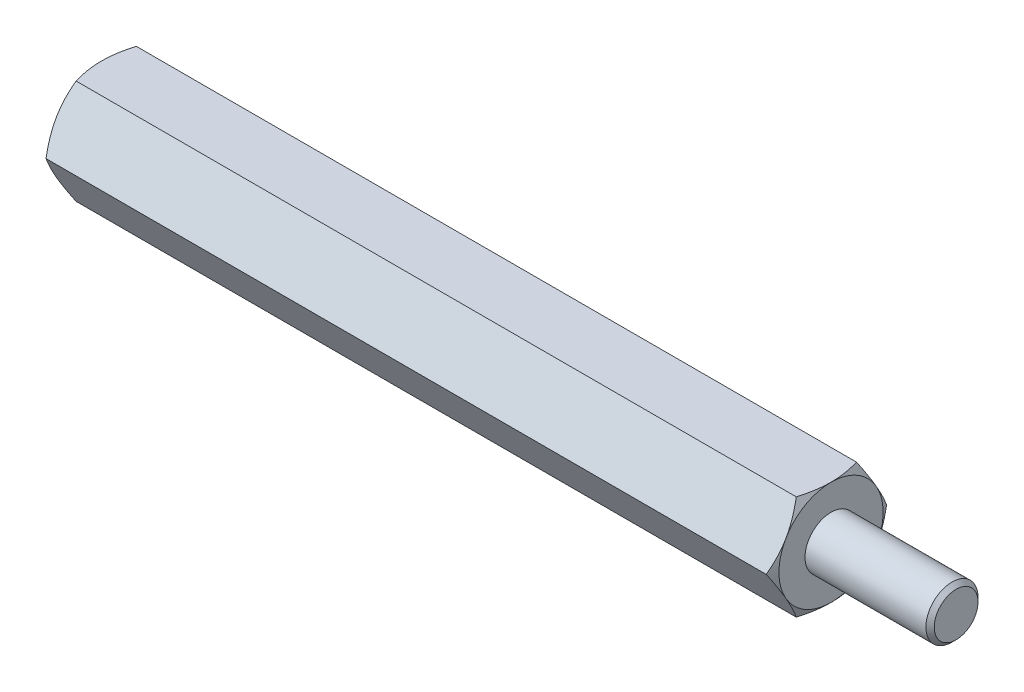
ISO-10303-21;
HEADER;
FILE_DESCRIPTION(('STEP AP214'),'2;1');
FILE_NAME('part.step','',(''),(''),'','','');
FILE_SCHEMA(('AUTOMOTIVE_DESIGN { 1 0 10303 214 1 1 1 1 }'));
ENDSEC;
DATA;
#1=APPLICATION_CONTEXT('core data for automotive mechanical design processes');
#2=APPLICATION_PROTOCOL_DEFINITION('international standard','automotive_design',2000,#1);
#3=PRODUCT_CONTEXT('',#1,'mechanical');
#4=PRODUCT('Part','Part','',(#3));
#5=PRODUCT_RELATED_PRODUCT_CATEGORY('part','',(#4));
#6=PRODUCT_DEFINITION_FORMATION('','',#4);
#7=PRODUCT_DEFINITION_CONTEXT('part definition',#1,'design');
#8=PRODUCT_DEFINITION('design','',#6,#7);
#9=PRODUCT_DEFINITION_SHAPE('','',#8);
#10=(LENGTH_UNIT() NAMED_UNIT(*) SI_UNIT(.MILLI.,.METRE.));
#11=(NAMED_UNIT(*) PLANE_ANGLE_UNIT() SI_UNIT($,.RADIAN.));
#12=(NAMED_UNIT(*) SI_UNIT($,.STERADIAN.) SOLID_ANGLE_UNIT());
#13=UNCERTAINTY_MEASURE_WITH_UNIT(LENGTH_MEASURE(1.E-05),#10,'distance_accuracy_value','');
#14=(GEOMETRIC_REPRESENTATION_CONTEXT(3) GLOBAL_UNCERTAINTY_ASSIGNED_CONTEXT((#13)) GLOBAL_UNIT_ASSIGNED_CONTEXT((#10,
#11,#12)) REPRESENTATION_CONTEXT('',''));
#15=CARTESIAN_POINT('',(0.,0.,0.));
#16=DIRECTION('',(0.,0.,1.));
#17=DIRECTION('',(1.,0.,0.));
#18=AXIS2_PLACEMENT_3D('',#15,#16,#17);
#19=CARTESIAN_POINT('',(17.5,2.5,-1.44337567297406));
#20=DIRECTION('',(1.,0.,0.));
#21=DIRECTION('',(0.,0.,-1.));
#22=AXIS2_PLACEMENT_3D('',#19,#20,#21);
#23=PLANE('',#22);
#24=CARTESIAN_POINT('',(17.5,0.,0.));
#25=DIRECTION('',(1.,0.,0.));
#26=DIRECTION('',(0.,0.,-1.));
#27=AXIS2_PLACEMENT_3D('',#24,#25,#26);
#28=CIRCLE('',#27,2.5);
#29=CARTESIAN_POINT('',(17.5,-1.25,-2.1650635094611));
#30=VERTEX_POINT('',#29);
#31=CARTESIAN_POINT('',(17.5,1.25,-2.1650635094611));
#32=VERTEX_POINT('',#31);
#33=EDGE_CURVE('E288',#30,#32,#28,.T.);
#34=ORIENTED_EDGE('',*,*,#33,.T.);
#35=CARTESIAN_POINT('',(17.5,2.5,0.));
#36=VERTEX_POINT('',#35);
#37=EDGE_CURVE('E53',#32,#36,#28,.T.);
#38=ORIENTED_EDGE('',*,*,#37,.T.);
#39=CARTESIAN_POINT('',(17.5,1.25,2.1650635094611));
#40=VERTEX_POINT('',#39);
#41=EDGE_CURVE('E296',#36,#40,#28,.T.);
#42=ORIENTED_EDGE('',*,*,#41,.T.);
#43=CARTESIAN_POINT('',(17.5,-1.25000000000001,2.1650635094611));
#44=VERTEX_POINT('',#43);
#45=EDGE_CURVE('E300',#40,#44,#28,.T.);
#46=ORIENTED_EDGE('',*,*,#45,.T.);
#47=CARTESIAN_POINT('',(17.5,0.,0.));
#48=DIRECTION('',(-1.,0.,0.));
#49=DIRECTION('',(0.,-1.,0.));
#50=AXIS2_PLACEMENT_3D('',#47,#48,#49);
#51=CIRCLE('',#50,2.5);
#52=CARTESIAN_POINT('',(17.5,-2.50000000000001,0.));
#53=VERTEX_POINT('',#52);
#54=EDGE_CURVE('E193',#53,#44,#51,.T.);
#55=ORIENTED_EDGE('',*,*,#54,.F.);
#56=EDGE_CURVE('E61',#53,#30,#28,.T.);
#57=ORIENTED_EDGE('',*,*,#56,.T.);
#58=EDGE_LOOP('',(#34,#38,#42,#46,#55,#57));
#59=FACE_BOUND('',#58,.T.);
#60=CARTESIAN_POINT('',(17.5,0.,0.));
#61=DIRECTION('',(1.,0.,0.));
#62=DIRECTION('',(0.,0.,-1.));
#63=AXIS2_PLACEMENT_3D('',#60,#61,#62);
#64=CIRCLE('',#63,1.25);
#65=CARTESIAN_POINT('',(17.5,0.,-1.25));
#66=VERTEX_POINT('',#65);
#67=EDGE_CURVE('E310',#66,#66,#64,.T.);
#68=ORIENTED_EDGE('',*,*,#67,.F.);
#69=EDGE_LOOP('',(#68));
#70=FACE_BOUND('',#69,.T.);
#71=ADVANCED_FACE('F37',(#59,#70),#23,.T.);
#72=CARTESIAN_POINT('',(17.5,0.,-2.88675134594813));
#73=DIRECTION('',(0.,-0.5,0.866025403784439));
#74=DIRECTION('',(0.,-0.866025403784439,-0.5));
#75=AXIS2_PLACEMENT_3D('',#72,#73,#74);
#76=PLANE('',#75);
#77=CARTESIAN_POINT('',(17.2766423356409,-0.000199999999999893,-2.88686681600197));
#78=CARTESIAN_POINT('',(17.3132783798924,0.109663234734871,-2.82343724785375));
#79=CARTESIAN_POINT('',(17.346597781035,0.220474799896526,-2.75946016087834));
#80=CARTESIAN_POINT('',(17.4047577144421,0.44401683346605,-2.63039810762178));
#81=CARTESIAN_POINT('',(17.4295776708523,0.556751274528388,-2.5653108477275));
#82=CARTESIAN_POINT('',(17.468214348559,0.780822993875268,-2.43594298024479));
#83=CARTESIAN_POINT('',(17.4822882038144,0.892125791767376,-2.37168227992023));
#84=CARTESIAN_POINT('',(17.4990908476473,1.11525522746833,-2.24285844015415));
#85=CARTESIAN_POINT('',(17.5018335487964,1.22708105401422,-2.17829576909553));
#86=CARTESIAN_POINT('',(17.4961342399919,1.43604197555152,-2.05765212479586));
#87=CARTESIAN_POINT('',(17.4890916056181,1.53320831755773,-2.0015531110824));
#88=CARTESIAN_POINT('',(17.4667685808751,1.726907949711,-1.88972057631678));
#89=CARTESIAN_POINT('',(17.4514805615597,1.82344056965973,-1.8339874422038));
#90=CARTESIAN_POINT('',(17.4132609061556,2.01753972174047,-1.7219242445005));
#91=CARTESIAN_POINT('',(17.3901672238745,2.11508168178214,-1.66560836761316));
#92=CARTESIAN_POINT('',(17.3377533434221,2.30871060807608,-1.55381665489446));
#93=CARTESIAN_POINT('',(17.3084454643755,2.40480005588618,-1.49833938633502));
#94=CARTESIAN_POINT('',(17.2766423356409,2.5002,-1.44326020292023));
#95=B_SPLINE_CURVE_WITH_KNOTS('',3,(#77,#78,#79,#80,#81,#82,#83,#84,#85,#86,#87,#88,#89,#90,#91,
#92,#93,#94),.UNSPECIFIED.,.F.,.F.,(4,2,2,2,2,2,2,2,4),(0.,0.396285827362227,0.79352433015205,
1.18093086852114,1.56786160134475,1.90479741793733,2.24204551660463,2.58677531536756,
2.93082800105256),.UNSPECIFIED.);
#96=CARTESIAN_POINT('',(17.2767090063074,0.,-2.88675134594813));
#97=VERTEX_POINT('',#96);
#98=EDGE_CURVE('E348',#97,#32,#95,.T.);
#99=ORIENTED_EDGE('',*,*,#98,.F.);
#100=DIRECTION('',(-1.,0.,0.));
#101=VECTOR('',#100,1.);
#102=CARTESIAN_POINT('',(17.5,0.,-2.88675134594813));
#103=LINE('',#102,#101);
#104=CARTESIAN_POINT('',(-17.2767090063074,0.,-2.88675134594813));
#105=VERTEX_POINT('',#104);
#106=EDGE_CURVE('E264',#97,#105,#103,.T.);
#107=ORIENTED_EDGE('',*,*,#106,.T.);
#108=CARTESIAN_POINT('',(-17.2766423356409,2.5002,-1.44326020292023));
#109=CARTESIAN_POINT('',(-17.3132783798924,2.39033676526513,-1.50668977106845));
#110=CARTESIAN_POINT('',(-17.346597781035,2.27952520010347,-1.57066685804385));
#111=CARTESIAN_POINT('',(-17.4047577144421,2.05598316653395,-1.69972891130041));
#112=CARTESIAN_POINT('',(-17.4295776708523,1.94324872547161,-1.7648161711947));
#113=CARTESIAN_POINT('',(-17.468214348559,1.71917700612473,-1.8941840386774));
#114=CARTESIAN_POINT('',(-17.4822882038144,1.60787420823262,-1.95844473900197));
#115=CARTESIAN_POINT('',(-17.4990908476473,1.38474477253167,-2.08726857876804));
#116=CARTESIAN_POINT('',(-17.5018335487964,1.27291894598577,-2.15183124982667));
#117=CARTESIAN_POINT('',(-17.4961342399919,1.06395802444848,-2.27247489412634));
#118=CARTESIAN_POINT('',(-17.4890916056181,0.966791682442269,-2.32857390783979));
#119=CARTESIAN_POINT('',(-17.4667685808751,0.773092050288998,-2.44040644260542));
#120=CARTESIAN_POINT('',(-17.4514805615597,0.676559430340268,-2.49613957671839));
#121=CARTESIAN_POINT('',(-17.4132609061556,0.482460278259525,-2.60820277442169));
#122=CARTESIAN_POINT('',(-17.3901672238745,0.38491831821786,-2.66451865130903));
#123=CARTESIAN_POINT('',(-17.3377533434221,0.191289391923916,-2.77631036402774));
#124=CARTESIAN_POINT('',(-17.3084454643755,0.0951999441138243,-2.83178763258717));
#125=CARTESIAN_POINT('',(-17.2766423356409,-0.000200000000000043,-2.88686681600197));
#126=B_SPLINE_CURVE_WITH_KNOTS('',3,(#108,#109,#110,#111,#112,#113,#114,#115,#116,#117,#118,
#119,#120,#121,#122,#123,#124,#125),.UNSPECIFIED.,.F.,.F.,(4,2,2,2,2,2,2,2,4),(0.,
0.396285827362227,0.793524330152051,1.18093086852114,1.56786160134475,1.90479741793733,
2.24204551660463,2.58677531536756,2.93082800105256),.UNSPECIFIED.);
#127=CARTESIAN_POINT('',(-17.5,1.25,-2.1650635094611));
#128=VERTEX_POINT('',#127);
#129=EDGE_CURVE('E338',#128,#105,#126,.T.);
#130=ORIENTED_EDGE('',*,*,#129,.F.);
#131=CARTESIAN_POINT('',(-17.2767090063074,2.5,-1.44337567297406));
#132=VERTEX_POINT('',#131);
#133=EDGE_CURVE('E392',#132,#128,#126,.T.);
#134=ORIENTED_EDGE('',*,*,#133,.F.);
#135=DIRECTION('',(-1.,0.,0.));
#136=VECTOR('',#135,1.);
#137=CARTESIAN_POINT('',(17.5,2.5,-1.44337567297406));
#138=LINE('',#137,#136);
#139=CARTESIAN_POINT('',(17.2767090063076,2.5,-1.44337567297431));
#140=VERTEX_POINT('',#139);
#141=EDGE_CURVE('E279',#140,#132,#138,.T.);
#142=ORIENTED_EDGE('',*,*,#141,.F.);
#143=EDGE_CURVE('E229',#32,#140,#95,.T.);
#144=ORIENTED_EDGE('',*,*,#143,.F.);
#145=EDGE_LOOP('',(#99,#107,#130,#134,#142,#144));
#146=FACE_BOUND('',#145,.T.);
#147=ADVANCED_FACE('F148',(#146),#76,.F.);
#148=CARTESIAN_POINT('',(17.5,2.5,-1.44337567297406));
#149=DIRECTION('',(0.,-1.,0.));
#150=DIRECTION('',(0.,0.,-1.));
#151=AXIS2_PLACEMENT_3D('',#148,#149,#150);
#152=PLANE('',#151);
#153=CARTESIAN_POINT('',(16.2680338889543,2.5,-3.90158441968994));
#154=CARTESIAN_POINT('',(16.3212077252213,2.5,-3.79217004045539));
#155=CARTESIAN_POINT('',(16.3738786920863,2.5,-3.68250707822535));
#156=CARTESIAN_POINT('',(16.4779324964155,2.5,-3.46255185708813));
#157=CARTESIAN_POINT('',(16.5293151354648,2.5,-3.35225950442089));
#158=CARTESIAN_POINT('',(16.6307630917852,2.5,-3.13035696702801));
#159=CARTESIAN_POINT('',(16.6808199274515,2.5,-3.0187428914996));
#160=CARTESIAN_POINT('',(16.7789171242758,2.5,-2.79463535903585));
#161=CARTESIAN_POINT('',(16.8269575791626,2.5,-2.68214194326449));
#162=CARTESIAN_POINT('',(16.9220184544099,2.5,-2.45240385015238));
#163=CARTESIAN_POINT('',(16.9689543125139,2.5,-2.33512399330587));
#164=CARTESIAN_POINT('',(17.0593326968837,2.5,-2.09920133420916));
#165=CARTESIAN_POINT('',(17.1027748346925,2.5,-1.98055838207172));
#166=CARTESIAN_POINT('',(17.1850435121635,2.5,-1.74193489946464));
#167=CARTESIAN_POINT('',(17.2238791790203,2.5,-1.6219575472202));
#168=CARTESIAN_POINT('',(17.2957050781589,2.5,-1.38028205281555));
#169=CARTESIAN_POINT('',(17.3286971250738,2.5,-1.25858445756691));
#170=CARTESIAN_POINT('',(17.3870959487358,2.5,-1.01406369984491));
#171=CARTESIAN_POINT('',(17.4125437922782,2.5,-0.891250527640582));
#172=CARTESIAN_POINT('',(17.4544275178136,2.5,-0.64407172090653));
#173=CARTESIAN_POINT('',(17.4708643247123,2.5,-0.519706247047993));
#174=CARTESIAN_POINT('',(17.4932006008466,2.5,-0.271679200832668));
#175=CARTESIAN_POINT('',(17.4992375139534,2.5,-0.148030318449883));
#176=CARTESIAN_POINT('',(17.5006256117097,2.5,0.0993395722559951));
#177=CARTESIAN_POINT('',(17.4959765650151,2.5,0.223060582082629));
#178=CARTESIAN_POINT('',(17.4794044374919,2.5,0.432351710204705));
#179=CARTESIAN_POINT('',(17.4701066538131,2.5,0.518143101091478));
#180=CARTESIAN_POINT('',(17.4469384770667,2.5,0.689112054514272));
#181=CARTESIAN_POINT('',(17.4330674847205,2.5,0.774289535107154));
#182=CARTESIAN_POINT('',(17.3853202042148,2.5,1.02876599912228));
#183=CARTESIAN_POINT('',(17.3453176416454,2.5,1.19691958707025));
#184=CARTESIAN_POINT('',(17.2522656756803,2.5,1.53362893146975));
#185=CARTESIAN_POINT('',(17.1989362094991,2.5,1.70210423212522));
#186=CARTESIAN_POINT('',(17.1123716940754,2.5,1.95247339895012));
#187=CARTESIAN_POINT('',(17.0824247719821,2.5,2.0355318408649));
#188=CARTESIAN_POINT('',(17.0206840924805,2.5,2.20095860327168));
#189=CARTESIAN_POINT('',(16.9888903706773,2.5,2.28332693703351));
#190=CARTESIAN_POINT('',(16.904014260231,2.5,2.49723312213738));
#191=CARTESIAN_POINT('',(16.8497173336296,2.5,2.62828796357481));
#192=CARTESIAN_POINT('',(16.7381273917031,2.5,2.88912034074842));
#193=CARTESIAN_POINT('',(16.6808341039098,2.5,3.01889775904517));
#194=CARTESIAN_POINT('',(16.5639348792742,2.5,3.27745045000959));
#195=CARTESIAN_POINT('',(16.504328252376,2.5,3.40622540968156));
#196=CARTESIAN_POINT('',(16.3833234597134,2.5,3.66293235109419));
#197=CARTESIAN_POINT('',(16.321925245,2.5,3.7908643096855));
#198=CARTESIAN_POINT('',(16.1354580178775,2.5,4.17399495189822));
#199=CARTESIAN_POINT('',(16.0082824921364,2.5,4.42816724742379));
#200=CARTESIAN_POINT('',(15.7503455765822,2.5,4.9346146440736));
#201=CARTESIAN_POINT('',(15.6195848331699,2.5,5.1868900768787));
#202=CARTESIAN_POINT('',(15.3687100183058,2.5,5.66512451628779));
#203=CARTESIAN_POINT('',(15.2488298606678,2.5,5.89120644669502));
#204=CARTESIAN_POINT('',(15.0075902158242,2.5,6.34259369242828));
#205=CARTESIAN_POINT('',(14.8862306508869,2.5,6.56789896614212));
#206=CARTESIAN_POINT('',(14.642780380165,2.5,7.01722044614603));
#207=CARTESIAN_POINT('',(14.5206930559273,2.5,7.24123848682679));
#208=CARTESIAN_POINT('',(14.2756662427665,2.5,7.68878772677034));
#209=CARTESIAN_POINT('',(14.152726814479,2.5,7.91231895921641));
#210=CARTESIAN_POINT('',(14.0294756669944,2.5,8.1356769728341));
#211=B_SPLINE_CURVE_WITH_KNOTS('',3,(#153,#154,#155,#156,#157,#158,#159,#160,#161,#162,#163,
#164,#165,#166,#167,#168,#169,#170,#171,#172,#173,#174,#175,#176,#177,#178,#179,#180,#181,#182,
#183,#184,#185,#186,#187,#188,#189,#190,#191,#192,#193,#194,#195,#196,#197,#198,#199,#200,#201,
#202,#203,#204,#205,#206,#207,#208,#209,#210),.UNSPECIFIED.,.F.,.F.,(4,2,2,2,2,2,2,2,2,2,2,2,2,
2,2,2,2,2,2,2,2,2,2,2,2,2,2,2,4),(0.,0.364957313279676,0.729970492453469,1.09692930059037,
1.46387103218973,1.84279746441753,2.22176597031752,2.59997058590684,2.97805755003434,
3.3540469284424,3.72999770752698,4.10094071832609,4.47189175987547,4.73064905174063,
4.98944026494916,5.50729076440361,6.037104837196,6.30196454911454,6.56681915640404,
6.99233818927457,7.41789598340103,7.84358170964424,8.26927907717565,9.12186602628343,
9.97430025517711,10.7419897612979,11.5097197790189,12.2750964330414,13.0404191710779),.UNSPECIFIED.);
#212=EDGE_CURVE('E227',#140,#36,#211,.T.);
#213=ORIENTED_EDGE('',*,*,#212,.F.);
#214=ORIENTED_EDGE('',*,*,#141,.T.);
#215=CARTESIAN_POINT('',(-16.2680338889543,2.5,-3.90158441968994));
#216=CARTESIAN_POINT('',(-16.3212077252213,2.5,-3.79217004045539));
#217=CARTESIAN_POINT('',(-16.3738786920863,2.5,-3.68250707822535));
#218=CARTESIAN_POINT('',(-16.4779324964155,2.5,-3.46255185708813));
#219=CARTESIAN_POINT('',(-16.5293151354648,2.5,-3.35225950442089));
#220=CARTESIAN_POINT('',(-16.6307630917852,2.5,-3.13035696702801));
#221=CARTESIAN_POINT('',(-16.6808199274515,2.5,-3.0187428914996));
#222=CARTESIAN_POINT('',(-16.7789171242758,2.5,-2.79463535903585));
#223=CARTESIAN_POINT('',(-16.8269575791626,2.5,-2.68214194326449));
#224=CARTESIAN_POINT('',(-16.9220184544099,2.5,-2.45240385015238));
#225=CARTESIAN_POINT('',(-16.9689543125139,2.5,-2.33512399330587));
#226=CARTESIAN_POINT('',(-17.0593326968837,2.5,-2.09920133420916));
#227=CARTESIAN_POINT('',(-17.1027748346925,2.5,-1.98055838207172));
#228=CARTESIAN_POINT('',(-17.1850435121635,2.5,-1.74193489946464));
#229=CARTESIAN_POINT('',(-17.2238791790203,2.5,-1.6219575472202));
#230=CARTESIAN_POINT('',(-17.2957050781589,2.5,-1.38028205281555));
#231=CARTESIAN_POINT('',(-17.3286971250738,2.5,-1.25858445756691));
#232=CARTESIAN_POINT('',(-17.3870959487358,2.5,-1.01406369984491));
#233=CARTESIAN_POINT('',(-17.4125437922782,2.5,-0.891250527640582));
#234=CARTESIAN_POINT('',(-17.4544275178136,2.5,-0.64407172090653));
#235=CARTESIAN_POINT('',(-17.4708643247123,2.5,-0.519706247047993));
#236=CARTESIAN_POINT('',(-17.4932006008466,2.5,-0.271679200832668));
#237=CARTESIAN_POINT('',(-17.4992375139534,2.5,-0.148030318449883));
#238=CARTESIAN_POINT('',(-17.5006256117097,2.5,0.0993395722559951));
#239=CARTESIAN_POINT('',(-17.4959765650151,2.5,0.223060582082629));
#240=CARTESIAN_POINT('',(-17.4794044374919,2.5,0.432351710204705));
#241=CARTESIAN_POINT('',(-17.4701066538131,2.5,0.518143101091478));
#242=CARTESIAN_POINT('',(-17.4469384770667,2.5,0.689112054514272));
#243=CARTESIAN_POINT('',(-17.4330674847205,2.5,0.774289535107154));
#244=CARTESIAN_POINT('',(-17.3853202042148,2.5,1.02876599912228));
#245=CARTESIAN_POINT('',(-17.3453176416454,2.5,1.19691958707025));
#246=CARTESIAN_POINT('',(-17.2522656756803,2.5,1.53362893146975));
#247=CARTESIAN_POINT('',(-17.1989362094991,2.5,1.70210423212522));
#248=CARTESIAN_POINT('',(-17.1123716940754,2.5,1.95247339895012));
#249=CARTESIAN_POINT('',(-17.0824247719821,2.5,2.0355318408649));
#250=CARTESIAN_POINT('',(-17.0206840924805,2.5,2.20095860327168));
#251=CARTESIAN_POINT('',(-16.9888903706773,2.5,2.28332693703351));
#252=CARTESIAN_POINT('',(-16.904014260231,2.5,2.49723312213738));
#253=CARTESIAN_POINT('',(-16.8497173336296,2.5,2.62828796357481));
#254=CARTESIAN_POINT('',(-16.7381273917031,2.5,2.88912034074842));
#255=CARTESIAN_POINT('',(-16.6808341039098,2.5,3.01889775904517));
#256=CARTESIAN_POINT('',(-16.5639348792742,2.5,3.27745045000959));
#257=CARTESIAN_POINT('',(-16.504328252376,2.5,3.40622540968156));
#258=CARTESIAN_POINT('',(-16.3833234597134,2.5,3.66293235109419));
#259=CARTESIAN_POINT('',(-16.321925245,2.5,3.7908643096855));
#260=CARTESIAN_POINT('',(-16.1354580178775,2.5,4.17399495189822));
#261=CARTESIAN_POINT('',(-16.0082824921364,2.5,4.42816724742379));
#262=CARTESIAN_POINT('',(-15.7503455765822,2.5,4.9346146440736));
#263=CARTESIAN_POINT('',(-15.6195848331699,2.5,5.1868900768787));
#264=CARTESIAN_POINT('',(-15.3687100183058,2.5,5.66512451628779));
#265=CARTESIAN_POINT('',(-15.2488298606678,2.5,5.89120644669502));
#266=CARTESIAN_POINT('',(-15.0075902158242,2.5,6.34259369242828));
#267=CARTESIAN_POINT('',(-14.8862306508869,2.5,6.56789896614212));
#268=CARTESIAN_POINT('',(-14.642780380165,2.5,7.01722044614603));
#269=CARTESIAN_POINT('',(-14.5206930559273,2.5,7.24123848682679));
#270=CARTESIAN_POINT('',(-14.2756662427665,2.5,7.68878772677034));
#271=CARTESIAN_POINT('',(-14.152726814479,2.5,7.91231895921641));
#272=CARTESIAN_POINT('',(-14.0294756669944,2.5,8.1356769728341));
#273=B_SPLINE_CURVE_WITH_KNOTS('',3,(#215,#216,#217,#218,#219,#220,#221,#222,#223,#224,#225,
#226,#227,#228,#229,#230,#231,#232,#233,#234,#235,#236,#237,#238,#239,#240,#241,#242,#243,#244,
#245,#246,#247,#248,#249,#250,#251,#252,#253,#254,#255,#256,#257,#258,#259,#260,#261,#262,#263,
#264,#265,#266,#267,#268,#269,#270,#271,#272),.UNSPECIFIED.,.F.,.F.,(4,2,2,2,2,2,2,2,2,2,2,2,2,
2,2,2,2,2,2,2,2,2,2,2,2,2,2,2,4),(0.,0.364957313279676,0.729970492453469,1.09692930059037,
1.46387103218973,1.84279746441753,2.22176597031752,2.59997058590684,2.97805755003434,
3.3540469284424,3.72999770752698,4.10094071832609,4.47189175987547,4.73064905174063,
4.98944026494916,5.50729076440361,6.037104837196,6.30196454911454,6.56681915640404,
6.99233818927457,7.41789598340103,7.84358170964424,8.26927907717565,9.12186602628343,
9.97430025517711,10.7419897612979,11.5097197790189,12.2750964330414,13.0404191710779),.UNSPECIFIED.);
#274=CARTESIAN_POINT('',(-17.5,2.5,0.));
#275=VERTEX_POINT('',#274);
#276=EDGE_CURVE('E241',#275,#132,#273,.F.);
#277=ORIENTED_EDGE('',*,*,#276,.F.);
#278=CARTESIAN_POINT('',(-17.2767090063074,2.5,1.44337567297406));
#279=VERTEX_POINT('',#278);
#280=EDGE_CURVE('E249',#279,#275,#273,.F.);
#281=ORIENTED_EDGE('',*,*,#280,.F.);
#282=DIRECTION('',(-1.,0.,0.));
#283=VECTOR('',#282,1.);
#284=CARTESIAN_POINT('',(17.5,2.5,1.44337567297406));
#285=LINE('',#284,#283);
#286=CARTESIAN_POINT('',(17.2767090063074,2.5,1.44337567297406));
#287=VERTEX_POINT('',#286);
#288=EDGE_CURVE('E276',#287,#279,#285,.T.);
#289=ORIENTED_EDGE('',*,*,#288,.F.);
#290=EDGE_CURVE('E221',#36,#287,#211,.T.);
#291=ORIENTED_EDGE('',*,*,#290,.F.);
#292=EDGE_LOOP('',(#213,#214,#277,#281,#289,#291));
#293=FACE_BOUND('',#292,.T.);
#294=ADVANCED_FACE('F153',(#293),#152,.F.);
#295=CARTESIAN_POINT('',(17.5,2.5,1.44337567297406));
#296=DIRECTION('',(0.,-0.5,-0.866025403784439));
#297=DIRECTION('',(0.,0.866025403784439,-0.5));
#298=AXIS2_PLACEMENT_3D('',#295,#296,#297);
#299=PLANE('',#298);
#300=CARTESIAN_POINT('',(17.2766423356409,2.5002,1.44326020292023));
#301=CARTESIAN_POINT('',(17.3132783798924,2.39033676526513,1.50668977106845));
#302=CARTESIAN_POINT('',(17.3465977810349,2.27952520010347,1.57066685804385));
#303=CARTESIAN_POINT('',(17.4047577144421,2.05598316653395,1.69972891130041));
#304=CARTESIAN_POINT('',(17.4295776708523,1.94324872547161,1.7648161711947));
#305=CARTESIAN_POINT('',(17.468214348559,1.71917700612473,1.8941840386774));
#306=CARTESIAN_POINT('',(17.4822882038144,1.60787420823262,1.95844473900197));
#307=CARTESIAN_POINT('',(17.4990908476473,1.38474477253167,2.08726857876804));
#308=CARTESIAN_POINT('',(17.5018335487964,1.27291894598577,2.15183124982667));
#309=CARTESIAN_POINT('',(17.4961342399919,1.06395802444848,2.27247489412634));
#310=CARTESIAN_POINT('',(17.4890916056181,0.96679168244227,2.32857390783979));
#311=CARTESIAN_POINT('',(17.4667685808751,0.773092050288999,2.44040644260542));
#312=CARTESIAN_POINT('',(17.4514805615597,0.676559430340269,2.49613957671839));
#313=CARTESIAN_POINT('',(17.4132609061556,0.482460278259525,2.60820277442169));
#314=CARTESIAN_POINT('',(17.3901672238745,0.384918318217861,2.66451865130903));
#315=CARTESIAN_POINT('',(17.3377533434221,0.191289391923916,2.77631036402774));
#316=CARTESIAN_POINT('',(17.3084454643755,0.0951999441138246,2.83178763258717));
#317=CARTESIAN_POINT('',(17.2766423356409,-0.000199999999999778,2.88686681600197));
#318=B_SPLINE_CURVE_WITH_KNOTS('',3,(#300,#301,#302,#303,#304,#305,#306,#307,#308,#309,#310,
#311,#312,#313,#314,#315,#316,#317),.UNSPECIFIED.,.F.,.F.,(4,2,2,2,2,2,2,2,4),(0.,
0.396285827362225,0.793524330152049,1.18093086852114,1.56786160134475,1.90479741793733,
2.24204551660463,2.58677531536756,2.93082800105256),.UNSPECIFIED.);
#319=EDGE_CURVE('E228',#287,#40,#318,.T.);
#320=ORIENTED_EDGE('',*,*,#319,.F.);
#321=ORIENTED_EDGE('',*,*,#288,.T.);
#322=CARTESIAN_POINT('',(-17.2766423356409,-0.000199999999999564,2.88686681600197));
#323=CARTESIAN_POINT('',(-17.3132783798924,0.109663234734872,2.82343724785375));
#324=CARTESIAN_POINT('',(-17.346597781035,0.220474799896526,2.75946016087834));
#325=CARTESIAN_POINT('',(-17.4047577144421,0.44401683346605,2.63039810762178));
#326=CARTESIAN_POINT('',(-17.4295776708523,0.556751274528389,2.5653108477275));
#327=CARTESIAN_POINT('',(-17.468214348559,0.780822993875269,2.43594298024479));
#328=CARTESIAN_POINT('',(-17.4822882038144,0.892125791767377,2.37168227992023));
#329=CARTESIAN_POINT('',(-17.4990908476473,1.11525522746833,2.24285844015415));
#330=CARTESIAN_POINT('',(-17.5018335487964,1.22708105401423,2.17829576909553));
#331=CARTESIAN_POINT('',(-17.4961342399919,1.43604197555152,2.05765212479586));
#332=CARTESIAN_POINT('',(-17.4890916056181,1.53320831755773,2.0015531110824));
#333=CARTESIAN_POINT('',(-17.4667685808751,1.726907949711,1.88972057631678));
#334=CARTESIAN_POINT('',(-17.4514805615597,1.82344056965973,1.8339874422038));
#335=CARTESIAN_POINT('',(-17.4132609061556,2.01753972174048,1.7219242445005));
#336=CARTESIAN_POINT('',(-17.3901672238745,2.11508168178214,1.66560836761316));
#337=CARTESIAN_POINT('',(-17.3377533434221,2.30871060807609,1.55381665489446));
#338=CARTESIAN_POINT('',(-17.3084454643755,2.40480005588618,1.49833938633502));
#339=CARTESIAN_POINT('',(-17.2766423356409,2.5002,1.44326020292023));
#340=B_SPLINE_CURVE_WITH_KNOTS('',3,(#322,#323,#324,#325,#326,#327,#328,#329,#330,#331,#332,
#333,#334,#335,#336,#337,#338,#339),.UNSPECIFIED.,.F.,.F.,(4,2,2,2,2,2,2,2,4),(0.,
0.396285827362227,0.793524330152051,1.18093086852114,1.56786160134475,1.90479741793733,
2.24204551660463,2.58677531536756,2.93082800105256),.UNSPECIFIED.);
#341=CARTESIAN_POINT('',(-17.5,1.25,2.1650635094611));
#342=VERTEX_POINT('',#341);
#343=EDGE_CURVE('E255',#342,#279,#340,.T.);
#344=ORIENTED_EDGE('',*,*,#343,.F.);
#345=CARTESIAN_POINT('',(-17.2767090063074,0.,2.88675134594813));
#346=VERTEX_POINT('',#345);
#347=EDGE_CURVE('E262',#346,#342,#340,.T.);
#348=ORIENTED_EDGE('',*,*,#347,.F.);
#349=DIRECTION('',(-1.,0.,0.));
#350=VECTOR('',#349,1.);
#351=CARTESIAN_POINT('',(17.5,0.,2.88675134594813));
#352=LINE('',#351,#350);
#353=CARTESIAN_POINT('',(17.2767090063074,0.,2.88675134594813));
#354=VERTEX_POINT('',#353);
#355=EDGE_CURVE('E273',#354,#346,#352,.T.);
#356=ORIENTED_EDGE('',*,*,#355,.F.);
#357=EDGE_CURVE('E215',#40,#354,#318,.T.);
#358=ORIENTED_EDGE('',*,*,#357,.F.);
#359=EDGE_LOOP('',(#320,#321,#344,#348,#356,#358));
#360=FACE_BOUND('',#359,.T.);
#361=ADVANCED_FACE('F235',(#360),#299,.F.);
#362=CARTESIAN_POINT('',(17.5,0.,2.88675134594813));
#363=DIRECTION('',(0.,0.5,-0.866025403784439));
#364=DIRECTION('',(0.,0.866025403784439,0.5));
#365=AXIS2_PLACEMENT_3D('',#362,#363,#364);
#366=PLANE('',#365);
#367=CARTESIAN_POINT('',(17.2766423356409,0.000200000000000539,2.88686681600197));
#368=CARTESIAN_POINT('',(17.3132783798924,-0.109663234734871,2.82343724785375));
#369=CARTESIAN_POINT('',(17.346597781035,-0.220474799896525,2.75946016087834));
#370=CARTESIAN_POINT('',(17.4047577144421,-0.444016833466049,2.63039810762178));
#371=CARTESIAN_POINT('',(17.4295776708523,-0.556751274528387,2.5653108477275));
#372=CARTESIAN_POINT('',(17.468214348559,-0.780822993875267,2.43594298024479));
#373=CARTESIAN_POINT('',(17.4822882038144,-0.892125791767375,2.37168227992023));
#374=CARTESIAN_POINT('',(17.4990908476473,-1.11525522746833,2.24285844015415));
#375=CARTESIAN_POINT('',(17.5018335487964,-1.22708105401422,2.17829576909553));
#376=CARTESIAN_POINT('',(17.4961342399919,-1.43604197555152,2.05765212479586));
#377=CARTESIAN_POINT('',(17.4890916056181,-1.53320831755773,2.0015531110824));
#378=CARTESIAN_POINT('',(17.4667685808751,-1.726907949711,1.88972057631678));
#379=CARTESIAN_POINT('',(17.4514805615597,-1.82344056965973,1.8339874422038));
#380=CARTESIAN_POINT('',(17.4132609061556,-2.01753972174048,1.7219242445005));
#381=CARTESIAN_POINT('',(17.3901672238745,-2.11508168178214,1.66560836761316));
#382=CARTESIAN_POINT('',(17.3377533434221,-2.30871060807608,1.55381665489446));
#383=CARTESIAN_POINT('',(17.3084454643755,-2.40480005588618,1.49833938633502));
#384=CARTESIAN_POINT('',(17.2766423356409,-2.5002,1.44326020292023));
#385=B_SPLINE_CURVE_WITH_KNOTS('',3,(#367,#368,#369,#370,#371,#372,#373,#374,#375,#376,#377,
#378,#379,#380,#381,#382,#383,#384),.UNSPECIFIED.,.F.,.F.,(4,2,2,2,2,2,2,2,4),(0.,
0.396285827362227,0.793524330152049,1.18093086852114,1.56786160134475,1.90479741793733,
2.24204551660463,2.58677531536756,2.93082800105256),.UNSPECIFIED.);
#386=EDGE_CURVE('E372',#354,#44,#385,.T.);
#387=ORIENTED_EDGE('',*,*,#386,.F.);
#388=ORIENTED_EDGE('',*,*,#355,.T.);
#389=CARTESIAN_POINT('',(-17.2766423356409,-2.5002,1.44326020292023));
#390=CARTESIAN_POINT('',(-17.3132783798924,-2.39033676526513,1.50668977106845));
#391=CARTESIAN_POINT('',(-17.346597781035,-2.27952520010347,1.57066685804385));
#392=CARTESIAN_POINT('',(-17.4047577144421,-2.05598316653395,1.69972891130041));
#393=CARTESIAN_POINT('',(-17.4295776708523,-1.94324872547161,1.7648161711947));
#394=CARTESIAN_POINT('',(-17.468214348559,-1.71917700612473,1.8941840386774));
#395=CARTESIAN_POINT('',(-17.4822882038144,-1.60787420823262,1.95844473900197));
#396=CARTESIAN_POINT('',(-17.4990908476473,-1.38474477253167,2.08726857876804));
#397=CARTESIAN_POINT('',(-17.5018335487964,-1.27291894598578,2.15183124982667));
#398=CARTESIAN_POINT('',(-17.4961342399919,-1.06395802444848,2.27247489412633));
#399=CARTESIAN_POINT('',(-17.4890916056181,-0.966791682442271,2.32857390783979));
#400=CARTESIAN_POINT('',(-17.4667685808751,-0.773092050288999,2.44040644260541));
#401=CARTESIAN_POINT('',(-17.4514805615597,-0.676559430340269,2.49613957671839));
#402=CARTESIAN_POINT('',(-17.4132609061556,-0.482460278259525,2.60820277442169));
#403=CARTESIAN_POINT('',(-17.3901672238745,-0.384918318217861,2.66451865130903));
#404=CARTESIAN_POINT('',(-17.3377533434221,-0.191289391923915,2.77631036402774));
#405=CARTESIAN_POINT('',(-17.3084454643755,-0.0951999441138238,2.83178763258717));
#406=CARTESIAN_POINT('',(-17.2766423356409,0.00020000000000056,2.88686681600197));
#407=B_SPLINE_CURVE_WITH_KNOTS('',3,(#389,#390,#391,#392,#393,#394,#395,#396,#397,#398,#399,
#400,#401,#402,#403,#404,#405,#406),.UNSPECIFIED.,.F.,.F.,(4,2,2,2,2,2,2,2,4),(0.,
0.396285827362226,0.793524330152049,1.18093086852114,1.56786160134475,1.90479741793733,
2.24204551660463,2.58677531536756,2.93082800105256),.UNSPECIFIED.);
#408=CARTESIAN_POINT('',(-17.5,-1.25000000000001,2.1650635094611));
#409=VERTEX_POINT('',#408);
#410=EDGE_CURVE('E263',#409,#346,#407,.T.);
#411=ORIENTED_EDGE('',*,*,#410,.F.);
#412=CARTESIAN_POINT('',(-17.2767090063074,-2.5,1.44337567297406));
#413=VERTEX_POINT('',#412);
#414=EDGE_CURVE('E250',#413,#409,#407,.T.);
#415=ORIENTED_EDGE('',*,*,#414,.F.);
#416=DIRECTION('',(-1.,0.,0.));
#417=VECTOR('',#416,1.);
#418=CARTESIAN_POINT('',(17.5,-2.5,1.44337567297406));
#419=LINE('',#418,#417);
#420=CARTESIAN_POINT('',(17.2767090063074,-2.5,1.44337567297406));
#421=VERTEX_POINT('',#420);
#422=EDGE_CURVE('E270',#421,#413,#419,.T.);
#423=ORIENTED_EDGE('',*,*,#422,.F.);
#424=EDGE_CURVE('E210',#44,#421,#385,.T.);
#425=ORIENTED_EDGE('',*,*,#424,.F.);
#426=EDGE_LOOP('',(#387,#388,#411,#415,#423,#425));
#427=FACE_BOUND('',#426,.T.);
#428=ADVANCED_FACE('F442',(#427),#366,.F.);
#429=CARTESIAN_POINT('',(17.5,-2.5,1.44337567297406));
#430=DIRECTION('',(0.,1.,0.));
#431=DIRECTION('',(0.,0.,1.));
#432=AXIS2_PLACEMENT_3D('',#429,#430,#431);
#433=PLANE('',#432);
#434=CARTESIAN_POINT('',(16.2680338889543,-2.5,-3.90158441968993));
#435=CARTESIAN_POINT('',(16.3212077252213,-2.5,-3.79217004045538));
#436=CARTESIAN_POINT('',(16.3738786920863,-2.5,-3.68250707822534));
#437=CARTESIAN_POINT('',(16.4779324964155,-2.5,-3.46255185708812));
#438=CARTESIAN_POINT('',(16.5293151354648,-2.5,-3.35225950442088));
#439=CARTESIAN_POINT('',(16.6307630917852,-2.5,-3.130356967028));
#440=CARTESIAN_POINT('',(16.6808199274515,-2.5,-3.01874289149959));
#441=CARTESIAN_POINT('',(16.7789171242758,-2.5,-2.79463535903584));
#442=CARTESIAN_POINT('',(16.8269575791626,-2.5,-2.68214194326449));
#443=CARTESIAN_POINT('',(16.9220184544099,-2.5,-2.45240385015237));
#444=CARTESIAN_POINT('',(16.9689543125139,-2.5,-2.33512399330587));
#445=CARTESIAN_POINT('',(17.0593326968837,-2.5,-2.09920133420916));
#446=CARTESIAN_POINT('',(17.1027748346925,-2.5,-1.98055838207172));
#447=CARTESIAN_POINT('',(17.1850435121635,-2.5,-1.74193489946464));
#448=CARTESIAN_POINT('',(17.2238791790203,-2.5,-1.6219575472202));
#449=CARTESIAN_POINT('',(17.2957050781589,-2.5,-1.38028205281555));
#450=CARTESIAN_POINT('',(17.3286971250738,-2.5,-1.25858445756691));
#451=CARTESIAN_POINT('',(17.3870959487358,-2.5,-1.01406369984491));
#452=CARTESIAN_POINT('',(17.4125437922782,-2.5,-0.891250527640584));
#453=CARTESIAN_POINT('',(17.4544275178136,-2.5,-0.644071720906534));
#454=CARTESIAN_POINT('',(17.4708643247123,-2.5,-0.519706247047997));
#455=CARTESIAN_POINT('',(17.4932006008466,-2.5,-0.271679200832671));
#456=CARTESIAN_POINT('',(17.4992375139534,-2.5,-0.148030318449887));
#457=CARTESIAN_POINT('',(17.5006256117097,-2.5,0.09933957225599));
#458=CARTESIAN_POINT('',(17.4959765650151,-2.5,0.223060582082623));
#459=CARTESIAN_POINT('',(17.479404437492,-2.5,0.432351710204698));
#460=CARTESIAN_POINT('',(17.4701066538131,-2.5,0.518143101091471));
#461=CARTESIAN_POINT('',(17.4469384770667,-2.5,0.689112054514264));
#462=CARTESIAN_POINT('',(17.4330674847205,-2.5,0.774289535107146));
#463=CARTESIAN_POINT('',(17.3853202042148,-2.5,1.02876599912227));
#464=CARTESIAN_POINT('',(17.3453176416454,-2.5,1.19691958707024));
#465=CARTESIAN_POINT('',(17.2522656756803,-2.5,1.53362893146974));
#466=CARTESIAN_POINT('',(17.1989362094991,-2.5,1.70210423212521));
#467=CARTESIAN_POINT('',(17.1123716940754,-2.5,1.95247339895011));
#468=CARTESIAN_POINT('',(17.0824247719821,-2.5,2.03553184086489));
#469=CARTESIAN_POINT('',(17.0206840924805,-2.5,2.20095860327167));
#470=CARTESIAN_POINT('',(16.9888903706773,-2.5,2.2833269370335));
#471=CARTESIAN_POINT('',(16.904014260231,-2.5,2.49723312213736));
#472=CARTESIAN_POINT('',(16.8497173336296,-2.5,2.6282879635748));
#473=CARTESIAN_POINT('',(16.7381273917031,-2.5,2.88912034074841));
#474=CARTESIAN_POINT('',(16.6808341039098,-2.5,3.01889775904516));
#475=CARTESIAN_POINT('',(16.5639348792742,-2.5,3.27745045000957));
#476=CARTESIAN_POINT('',(16.504328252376,-2.5,3.40622540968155));
#477=CARTESIAN_POINT('',(16.3833234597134,-2.5,3.66293235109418));
#478=CARTESIAN_POINT('',(16.321925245,-2.5,3.79086430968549));
#479=CARTESIAN_POINT('',(16.1354580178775,-2.5,4.17399495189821));
#480=CARTESIAN_POINT('',(16.0082824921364,-2.5,4.42816724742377));
#481=CARTESIAN_POINT('',(15.7503455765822,-2.5,4.93461464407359));
#482=CARTESIAN_POINT('',(15.6195848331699,-2.5,5.18689007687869));
#483=CARTESIAN_POINT('',(15.3687100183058,-2.5,5.66512451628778));
#484=CARTESIAN_POINT('',(15.2488298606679,-2.5,5.89120644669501));
#485=CARTESIAN_POINT('',(15.0075902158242,-2.5,6.34259369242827));
#486=CARTESIAN_POINT('',(14.8862306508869,-2.5,6.56789896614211));
#487=CARTESIAN_POINT('',(14.642780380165,-2.5,7.01722044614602));
#488=CARTESIAN_POINT('',(14.5206930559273,-2.5,7.24123848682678));
#489=CARTESIAN_POINT('',(14.2756662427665,-2.5,7.68878772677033));
#490=CARTESIAN_POINT('',(14.152726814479,-2.5,7.9123189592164));
#491=CARTESIAN_POINT('',(14.0294756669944,-2.5,8.13567697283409));
#492=B_SPLINE_CURVE_WITH_KNOTS('',3,(#434,#435,#436,#437,#438,#439,#440,#441,#442,#443,#444,
#445,#446,#447,#448,#449,#450,#451,#452,#453,#454,#455,#456,#457,#458,#459,#460,#461,#462,#463,
#464,#465,#466,#467,#468,#469,#470,#471,#472,#473,#474,#475,#476,#477,#478,#479,#480,#481,#482,
#483,#484,#485,#486,#487,#488,#489,#490,#491),.UNSPECIFIED.,.F.,.F.,(4,2,2,2,2,2,2,2,2,2,2,2,2,
2,2,2,2,2,2,2,2,2,2,2,2,2,2,2,4),(0.,0.364957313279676,0.729970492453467,1.09692930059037,
1.46387103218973,1.84279746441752,2.22176597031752,2.59997058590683,2.97805755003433,
3.35404692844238,3.72999770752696,4.10094071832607,4.47189175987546,4.73064905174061,
4.98944026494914,5.50729076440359,6.03710483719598,6.30196454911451,6.56681915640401,
6.99233818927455,7.417895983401,7.84358170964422,8.26927907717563,9.12186602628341,
9.97430025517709,10.7419897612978,11.5097197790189,12.2750964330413,13.0404191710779),.UNSPECIFIED.);
#493=EDGE_CURVE('E377',#421,#53,#492,.F.);
#494=ORIENTED_EDGE('',*,*,#493,.F.);
#495=ORIENTED_EDGE('',*,*,#422,.T.);
#496=CARTESIAN_POINT('',(-16.2680338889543,-2.5,-3.90158441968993));
#497=CARTESIAN_POINT('',(-16.3212077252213,-2.5,-3.79217004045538));
#498=CARTESIAN_POINT('',(-16.3738786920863,-2.5,-3.68250707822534));
#499=CARTESIAN_POINT('',(-16.4779324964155,-2.5,-3.46255185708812));
#500=CARTESIAN_POINT('',(-16.5293151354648,-2.5,-3.35225950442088));
#501=CARTESIAN_POINT('',(-16.6307630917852,-2.5,-3.130356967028));
#502=CARTESIAN_POINT('',(-16.6808199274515,-2.5,-3.01874289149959));
#503=CARTESIAN_POINT('',(-16.7789171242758,-2.5,-2.79463535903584));
#504=CARTESIAN_POINT('',(-16.8269575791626,-2.5,-2.68214194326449));
#505=CARTESIAN_POINT('',(-16.9220184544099,-2.5,-2.45240385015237));
#506=CARTESIAN_POINT('',(-16.9689543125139,-2.5,-2.33512399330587));
#507=CARTESIAN_POINT('',(-17.0593326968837,-2.5,-2.09920133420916));
#508=CARTESIAN_POINT('',(-17.1027748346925,-2.5,-1.98055838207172));
#509=CARTESIAN_POINT('',(-17.1850435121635,-2.5,-1.74193489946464));
#510=CARTESIAN_POINT('',(-17.2238791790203,-2.5,-1.6219575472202));
#511=CARTESIAN_POINT('',(-17.2957050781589,-2.5,-1.38028205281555));
#512=CARTESIAN_POINT('',(-17.3286971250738,-2.5,-1.25858445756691));
#513=CARTESIAN_POINT('',(-17.3870959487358,-2.5,-1.01406369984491));
#514=CARTESIAN_POINT('',(-17.4125437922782,-2.5,-0.891250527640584));
#515=CARTESIAN_POINT('',(-17.4544275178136,-2.5,-0.644071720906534));
#516=CARTESIAN_POINT('',(-17.4708643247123,-2.5,-0.519706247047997));
#517=CARTESIAN_POINT('',(-17.4932006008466,-2.5,-0.271679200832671));
#518=CARTESIAN_POINT('',(-17.4992375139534,-2.5,-0.148030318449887));
#519=CARTESIAN_POINT('',(-17.5006256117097,-2.5,0.09933957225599));
#520=CARTESIAN_POINT('',(-17.4959765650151,-2.5,0.223060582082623));
#521=CARTESIAN_POINT('',(-17.479404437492,-2.5,0.432351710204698));
#522=CARTESIAN_POINT('',(-17.4701066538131,-2.5,0.518143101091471));
#523=CARTESIAN_POINT('',(-17.4469384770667,-2.5,0.689112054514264));
#524=CARTESIAN_POINT('',(-17.4330674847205,-2.5,0.774289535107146));
#525=CARTESIAN_POINT('',(-17.3853202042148,-2.5,1.02876599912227));
#526=CARTESIAN_POINT('',(-17.3453176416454,-2.5,1.19691958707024));
#527=CARTESIAN_POINT('',(-17.2522656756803,-2.5,1.53362893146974));
#528=CARTESIAN_POINT('',(-17.1989362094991,-2.5,1.70210423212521));
#529=CARTESIAN_POINT('',(-17.1123716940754,-2.5,1.95247339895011));
#530=CARTESIAN_POINT('',(-17.0824247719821,-2.5,2.03553184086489));
#531=CARTESIAN_POINT('',(-17.0206840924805,-2.5,2.20095860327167));
#532=CARTESIAN_POINT('',(-16.9888903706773,-2.5,2.2833269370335));
#533=CARTESIAN_POINT('',(-16.904014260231,-2.5,2.49723312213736));
#534=CARTESIAN_POINT('',(-16.8497173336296,-2.5,2.6282879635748));
#535=CARTESIAN_POINT('',(-16.7381273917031,-2.5,2.88912034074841));
#536=CARTESIAN_POINT('',(-16.6808341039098,-2.5,3.01889775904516));
#537=CARTESIAN_POINT('',(-16.5639348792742,-2.5,3.27745045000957));
#538=CARTESIAN_POINT('',(-16.504328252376,-2.5,3.40622540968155));
#539=CARTESIAN_POINT('',(-16.3833234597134,-2.5,3.66293235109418));
#540=CARTESIAN_POINT('',(-16.321925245,-2.5,3.79086430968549));
#541=CARTESIAN_POINT('',(-16.1354580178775,-2.5,4.17399495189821));
#542=CARTESIAN_POINT('',(-16.0082824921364,-2.5,4.42816724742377));
#543=CARTESIAN_POINT('',(-15.7503455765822,-2.5,4.93461464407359));
#544=CARTESIAN_POINT('',(-15.6195848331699,-2.5,5.18689007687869));
#545=CARTESIAN_POINT('',(-15.3687100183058,-2.5,5.66512451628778));
#546=CARTESIAN_POINT('',(-15.2488298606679,-2.5,5.89120644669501));
#547=CARTESIAN_POINT('',(-15.0075902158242,-2.5,6.34259369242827));
#548=CARTESIAN_POINT('',(-14.8862306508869,-2.5,6.56789896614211));
#549=CARTESIAN_POINT('',(-14.642780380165,-2.5,7.01722044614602));
#550=CARTESIAN_POINT('',(-14.5206930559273,-2.5,7.24123848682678));
#551=CARTESIAN_POINT('',(-14.2756662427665,-2.5,7.68878772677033));
#552=CARTESIAN_POINT('',(-14.152726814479,-2.5,7.9123189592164));
#553=CARTESIAN_POINT('',(-14.0294756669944,-2.5,8.13567697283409));
#554=B_SPLINE_CURVE_WITH_KNOTS('',3,(#496,#497,#498,#499,#500,#501,#502,#503,#504,#505,#506,
#507,#508,#509,#510,#511,#512,#513,#514,#515,#516,#517,#518,#519,#520,#521,#522,#523,#524,#525,
#526,#527,#528,#529,#530,#531,#532,#533,#534,#535,#536,#537,#538,#539,#540,#541,#542,#543,#544,
#545,#546,#547,#548,#549,#550,#551,#552,#553),.UNSPECIFIED.,.F.,.F.,(4,2,2,2,2,2,2,2,2,2,2,2,2,
2,2,2,2,2,2,2,2,2,2,2,2,2,2,2,4),(0.,0.364957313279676,0.729970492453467,1.09692930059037,
1.46387103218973,1.84279746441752,2.22176597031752,2.59997058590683,2.97805755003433,
3.35404692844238,3.72999770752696,4.10094071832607,4.47189175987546,4.73064905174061,
4.98944026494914,5.50729076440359,6.03710483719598,6.30196454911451,6.56681915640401,
6.99233818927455,7.417895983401,7.84358170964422,8.26927907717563,9.12186602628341,
9.97430025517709,10.7419897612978,11.5097197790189,12.2750964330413,13.0404191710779),.UNSPECIFIED.);
#555=CARTESIAN_POINT('',(-17.5,-2.50000000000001,0.));
#556=VERTEX_POINT('',#555);
#557=EDGE_CURVE('E339',#556,#413,#554,.T.);
#558=ORIENTED_EDGE('',*,*,#557,.F.);
#559=CARTESIAN_POINT('',(-17.2767090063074,-2.5,-1.44337567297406));
#560=VERTEX_POINT('',#559);
#561=EDGE_CURVE('E332',#560,#556,#554,.T.);
#562=ORIENTED_EDGE('',*,*,#561,.F.);
#563=DIRECTION('',(-1.,0.,0.));
#564=VECTOR('',#563,1.);
#565=CARTESIAN_POINT('',(17.5,-2.5,-1.44337567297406));
#566=LINE('',#565,#564);
#567=CARTESIAN_POINT('',(17.2767090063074,-2.5,-1.44337567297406));
#568=VERTEX_POINT('',#567);
#569=EDGE_CURVE('E267',#568,#560,#566,.T.);
#570=ORIENTED_EDGE('',*,*,#569,.F.);
#571=EDGE_CURVE('E195',#53,#568,#492,.F.);
#572=ORIENTED_EDGE('',*,*,#571,.F.);
#573=EDGE_LOOP('',(#494,#495,#558,#562,#570,#572));
#574=FACE_BOUND('',#573,.T.);
#575=ADVANCED_FACE('F172',(#574),#433,.F.);
#576=CARTESIAN_POINT('',(17.5,-2.5,-1.44337567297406));
#577=DIRECTION('',(0.,0.5,0.866025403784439));
#578=DIRECTION('',(0.,-0.866025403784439,0.5));
#579=AXIS2_PLACEMENT_3D('',#576,#577,#578);
#580=PLANE('',#579);
#581=CARTESIAN_POINT('',(17.2766423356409,-2.5002,-1.44326020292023));
#582=CARTESIAN_POINT('',(17.3132783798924,-2.39033676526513,-1.50668977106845));
#583=CARTESIAN_POINT('',(17.346597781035,-2.27952520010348,-1.57066685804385));
#584=CARTESIAN_POINT('',(17.4047577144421,-2.05598316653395,-1.69972891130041));
#585=CARTESIAN_POINT('',(17.4295776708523,-1.94324872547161,-1.7648161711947));
#586=CARTESIAN_POINT('',(17.468214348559,-1.71917700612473,-1.8941840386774));
#587=CARTESIAN_POINT('',(17.4822882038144,-1.60787420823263,-1.95844473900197));
#588=CARTESIAN_POINT('',(17.4990908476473,-1.38474477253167,-2.08726857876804));
#589=CARTESIAN_POINT('',(17.5018335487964,-1.27291894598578,-2.15183124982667));
#590=CARTESIAN_POINT('',(17.4961342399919,-1.06395802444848,-2.27247489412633));
#591=CARTESIAN_POINT('',(17.4890916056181,-0.966791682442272,-2.32857390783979));
#592=CARTESIAN_POINT('',(17.4667685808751,-0.773092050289,-2.44040644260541));
#593=CARTESIAN_POINT('',(17.4514805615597,-0.67655943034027,-2.49613957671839));
#594=CARTESIAN_POINT('',(17.4132609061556,-0.482460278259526,-2.60820277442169));
#595=CARTESIAN_POINT('',(17.3901672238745,-0.384918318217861,-2.66451865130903));
#596=CARTESIAN_POINT('',(17.3377533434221,-0.191289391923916,-2.77631036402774));
#597=CARTESIAN_POINT('',(17.3084454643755,-0.0951999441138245,-2.83178763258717));
#598=CARTESIAN_POINT('',(17.2766423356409,0.000200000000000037,-2.88686681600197));
#599=B_SPLINE_CURVE_WITH_KNOTS('',3,(#581,#582,#583,#584,#585,#586,#587,#588,#589,#590,#591,
#592,#593,#594,#595,#596,#597,#598),.UNSPECIFIED.,.F.,.F.,(4,2,2,2,2,2,2,2,4),(0.,
0.396285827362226,0.793524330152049,1.18093086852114,1.56786160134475,1.90479741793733,
2.24204551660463,2.58677531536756,2.93082800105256),.UNSPECIFIED.);
#600=EDGE_CURVE('E192',#568,#30,#599,.T.);
#601=ORIENTED_EDGE('',*,*,#600,.F.);
#602=ORIENTED_EDGE('',*,*,#569,.T.);
#603=CARTESIAN_POINT('',(-17.2766423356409,0.000200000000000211,-2.88686681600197));
#604=CARTESIAN_POINT('',(-17.3132783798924,-0.109663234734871,-2.82343724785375));
#605=CARTESIAN_POINT('',(-17.346597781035,-0.220474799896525,-2.75946016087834));
#606=CARTESIAN_POINT('',(-17.4047577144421,-0.444016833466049,-2.63039810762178));
#607=CARTESIAN_POINT('',(-17.4295776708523,-0.556751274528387,-2.5653108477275));
#608=CARTESIAN_POINT('',(-17.468214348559,-0.780822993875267,-2.43594298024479));
#609=CARTESIAN_POINT('',(-17.4822882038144,-0.892125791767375,-2.37168227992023));
#610=CARTESIAN_POINT('',(-17.4990908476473,-1.11525522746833,-2.24285844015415));
#611=CARTESIAN_POINT('',(-17.5018335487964,-1.22708105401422,-2.17829576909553));
#612=CARTESIAN_POINT('',(-17.4961342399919,-1.43604197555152,-2.05765212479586));
#613=CARTESIAN_POINT('',(-17.4890916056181,-1.53320831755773,-2.0015531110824));
#614=CARTESIAN_POINT('',(-17.4667685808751,-1.726907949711,-1.88972057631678));
#615=CARTESIAN_POINT('',(-17.4514805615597,-1.82344056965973,-1.8339874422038));
#616=CARTESIAN_POINT('',(-17.4132609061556,-2.01753972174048,-1.7219242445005));
#617=CARTESIAN_POINT('',(-17.3901672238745,-2.11508168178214,-1.66560836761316));
#618=CARTESIAN_POINT('',(-17.3377533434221,-2.30871060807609,-1.55381665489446));
#619=CARTESIAN_POINT('',(-17.3084454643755,-2.40480005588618,-1.49833938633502));
#620=CARTESIAN_POINT('',(-17.2766423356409,-2.5002,-1.44326020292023));
#621=B_SPLINE_CURVE_WITH_KNOTS('',3,(#603,#604,#605,#606,#607,#608,#609,#610,#611,#612,#613,
#614,#615,#616,#617,#618,#619,#620),.UNSPECIFIED.,.F.,.F.,(4,2,2,2,2,2,2,2,4),(0.,
0.396285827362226,0.793524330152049,1.18093086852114,1.56786160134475,1.90479741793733,
2.24204551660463,2.58677531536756,2.93082800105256),.UNSPECIFIED.);
#622=CARTESIAN_POINT('',(-17.5,-1.25,-2.1650635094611));
#623=VERTEX_POINT('',#622);
#624=EDGE_CURVE('E178',#623,#560,#621,.T.);
#625=ORIENTED_EDGE('',*,*,#624,.F.);
#626=EDGE_CURVE('E330',#105,#623,#621,.T.);
#627=ORIENTED_EDGE('',*,*,#626,.F.);
#628=ORIENTED_EDGE('',*,*,#106,.F.);
#629=EDGE_CURVE('E185',#30,#97,#599,.T.);
#630=ORIENTED_EDGE('',*,*,#629,.F.);
#631=EDGE_LOOP('',(#601,#602,#625,#627,#628,#630));
#632=FACE_BOUND('',#631,.T.);
#633=ADVANCED_FACE('F167',(#632),#580,.F.);
#634=CARTESIAN_POINT('',(-17.5,0.,0.));
#635=DIRECTION('',(1.,0.,0.));
#636=DIRECTION('',(0.,1.,0.));
#637=AXIS2_PLACEMENT_3D('',#634,#635,#636);
#638=CONICAL_SURFACE('',#637,2.5,1.04719755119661);
#639=ORIENTED_EDGE('',*,*,#129,.T.);
#640=ORIENTED_EDGE('',*,*,#626,.T.);
#641=CARTESIAN_POINT('',(-17.5,0.,0.));
#642=DIRECTION('',(1.,0.,0.));
#643=DIRECTION('',(0.,0.,-1.));
#644=AXIS2_PLACEMENT_3D('',#641,#642,#643);
#645=CIRCLE('',#644,2.5);
#646=EDGE_CURVE('E282',#623,#128,#645,.T.);
#647=ORIENTED_EDGE('',*,*,#646,.T.);
#648=EDGE_LOOP('',(#639,#640,#647));
#649=FACE_BOUND('',#648,.T.);
#650=ADVANCED_FACE('F171',(#649),#638,.T.);
#651=ORIENTED_EDGE('',*,*,#561,.T.);
#652=EDGE_CURVE('E286',#556,#623,#645,.T.);
#653=ORIENTED_EDGE('',*,*,#652,.T.);
#654=ORIENTED_EDGE('',*,*,#624,.T.);
#655=EDGE_LOOP('',(#651,#653,#654));
#656=FACE_BOUND('',#655,.T.);
#657=ADVANCED_FACE('F407',(#656),#638,.T.);
#658=ORIENTED_EDGE('',*,*,#414,.T.);
#659=CARTESIAN_POINT('',(-17.5,0.,0.));
#660=DIRECTION('',(-1.,0.,0.));
#661=DIRECTION('',(0.,-1.,0.));
#662=AXIS2_PLACEMENT_3D('',#659,#660,#661);
#663=CIRCLE('',#662,2.5);
#664=EDGE_CURVE('E341',#556,#409,#663,.T.);
#665=ORIENTED_EDGE('',*,*,#664,.F.);
#666=ORIENTED_EDGE('',*,*,#557,.T.);
#667=EDGE_LOOP('',(#658,#665,#666));
#668=FACE_BOUND('',#667,.T.);
#669=ADVANCED_FACE('F425',(#668),#638,.T.);
#670=ORIENTED_EDGE('',*,*,#347,.T.);
#671=EDGE_CURVE('E402',#342,#409,#645,.T.);
#672=ORIENTED_EDGE('',*,*,#671,.T.);
#673=ORIENTED_EDGE('',*,*,#410,.T.);
#674=EDGE_LOOP('',(#670,#672,#673));
#675=FACE_BOUND('',#674,.T.);
#676=ADVANCED_FACE('F158',(#675),#638,.T.);
#677=ORIENTED_EDGE('',*,*,#343,.T.);
#678=ORIENTED_EDGE('',*,*,#280,.T.);
#679=EDGE_CURVE('E399',#275,#342,#645,.T.);
#680=ORIENTED_EDGE('',*,*,#679,.T.);
#681=EDGE_LOOP('',(#677,#678,#680));
#682=FACE_BOUND('',#681,.T.);
#683=ADVANCED_FACE('F433',(#682),#638,.T.);
#684=ORIENTED_EDGE('',*,*,#276,.T.);
#685=ORIENTED_EDGE('',*,*,#133,.T.);
#686=EDGE_CURVE('E287',#128,#275,#645,.T.);
#687=ORIENTED_EDGE('',*,*,#686,.T.);
#688=EDGE_LOOP('',(#684,#685,#687));
#689=FACE_BOUND('',#688,.T.);
#690=ADVANCED_FACE('F165',(#689),#638,.T.);
#691=CARTESIAN_POINT('',(-17.5,2.5,-1.44337567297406));
#692=DIRECTION('',(1.,0.,0.));
#693=DIRECTION('',(0.,0.,-1.));
#694=AXIS2_PLACEMENT_3D('',#691,#692,#693);
#695=PLANE('',#694);
#696=CARTESIAN_POINT('',(-17.5,0.,0.));
#697=DIRECTION('',(-1.,0.,0.));
#698=DIRECTION('',(0.,0.,1.));
#699=AXIS2_PLACEMENT_3D('',#696,#697,#698);
#700=CIRCLE('',#699,1.05);
#701=CARTESIAN_POINT('',(-17.5,0.,1.05));
#702=VERTEX_POINT('',#701);
#703=EDGE_CURVE('E312',#702,#702,#700,.T.);
#704=ORIENTED_EDGE('',*,*,#703,.F.);
#705=EDGE_LOOP('',(#704));
#706=FACE_BOUND('',#705,.T.);
#707=ORIENTED_EDGE('',*,*,#686,.F.);
#708=ORIENTED_EDGE('',*,*,#646,.F.);
#709=ORIENTED_EDGE('',*,*,#652,.F.);
#710=ORIENTED_EDGE('',*,*,#664,.T.);
#711=ORIENTED_EDGE('',*,*,#671,.F.);
#712=ORIENTED_EDGE('',*,*,#679,.F.);
#713=EDGE_LOOP('',(#707,#708,#709,#710,#711,#712));
#714=FACE_BOUND('',#713,.T.);
#715=ADVANCED_FACE('F161',(#706,#714),#695,.F.);
#716=CARTESIAN_POINT('',(17.5,0.,0.));
#717=DIRECTION('',(-1.,0.,0.));
#718=DIRECTION('',(0.,1.,0.));
#719=AXIS2_PLACEMENT_3D('',#716,#717,#718);
#720=CONICAL_SURFACE('',#719,2.5,1.04719755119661);
#721=ORIENTED_EDGE('',*,*,#98,.T.);
#722=ORIENTED_EDGE('',*,*,#33,.F.);
#723=ORIENTED_EDGE('',*,*,#629,.T.);
#724=EDGE_LOOP('',(#721,#722,#723));
#725=FACE_BOUND('',#724,.T.);
#726=ADVANCED_FACE('F164',(#725),#720,.T.);
#727=ORIENTED_EDGE('',*,*,#571,.T.);
#728=ORIENTED_EDGE('',*,*,#600,.T.);
#729=ORIENTED_EDGE('',*,*,#56,.F.);
#730=EDGE_LOOP('',(#727,#728,#729));
#731=FACE_BOUND('',#730,.T.);
#732=ADVANCED_FACE('F202',(#731),#720,.T.);
#733=ORIENTED_EDGE('',*,*,#424,.T.);
#734=ORIENTED_EDGE('',*,*,#493,.T.);
#735=ORIENTED_EDGE('',*,*,#54,.T.);
#736=EDGE_LOOP('',(#733,#734,#735));
#737=FACE_BOUND('',#736,.T.);
#738=ADVANCED_FACE('F519',(#737),#720,.T.);
#739=ORIENTED_EDGE('',*,*,#357,.T.);
#740=ORIENTED_EDGE('',*,*,#386,.T.);
#741=ORIENTED_EDGE('',*,*,#45,.F.);
#742=EDGE_LOOP('',(#739,#740,#741));
#743=FACE_BOUND('',#742,.T.);
#744=ADVANCED_FACE('F370',(#743),#720,.T.);
#745=ORIENTED_EDGE('',*,*,#290,.T.);
#746=ORIENTED_EDGE('',*,*,#319,.T.);
#747=ORIENTED_EDGE('',*,*,#41,.F.);
#748=EDGE_LOOP('',(#745,#746,#747));
#749=FACE_BOUND('',#748,.T.);
#750=ADVANCED_FACE('F364',(#749),#720,.T.);
#751=ORIENTED_EDGE('',*,*,#143,.T.);
#752=ORIENTED_EDGE('',*,*,#212,.T.);
#753=ORIENTED_EDGE('',*,*,#37,.F.);
#754=EDGE_LOOP('',(#751,#752,#753));
#755=FACE_BOUND('',#754,.T.);
#756=ADVANCED_FACE('F143',(#755),#720,.T.);
#757=CARTESIAN_POINT('',(-11.5,0.,0.));
#758=DIRECTION('',(-1.,0.,0.));
#759=DIRECTION('',(0.,0.,1.));
#760=AXIS2_PLACEMENT_3D('',#757,#758,#759);
#761=CYLINDRICAL_SURFACE('',#760,1.05);
#762=CARTESIAN_POINT('',(-11.5,0.,0.));
#763=DIRECTION('',(1.,0.,0.));
#764=DIRECTION('',(0.,0.,-1.));
#765=AXIS2_PLACEMENT_3D('',#762,#763,#764);
#766=CIRCLE('',#765,1.05);
#767=CARTESIAN_POINT('',(-11.5,0.,-1.05));
#768=VERTEX_POINT('',#767);
#769=EDGE_CURVE('E316',#768,#768,#766,.T.);
#770=ORIENTED_EDGE('',*,*,#769,.T.);
#771=EDGE_LOOP('',(#770));
#772=FACE_BOUND('',#771,.T.);
#773=ORIENTED_EDGE('',*,*,#703,.T.);
#774=EDGE_LOOP('',(#773));
#775=FACE_BOUND('',#774,.T.);
#776=ADVANCED_FACE('F133',(#772,#775),#761,.F.);
#777=CARTESIAN_POINT('',(-10.8937822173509,0.,0.));
#778=DIRECTION('',(-1.,0.,0.));
#779=DIRECTION('',(0.,0.,1.));
#780=AXIS2_PLACEMENT_3D('',#777,#778,#779);
#781=CONICAL_SURFACE('',#780,0.,1.0471975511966);
#782=ORIENTED_EDGE('',*,*,#769,.F.);
#783=EDGE_LOOP('',(#782));
#784=FACE_BOUND('',#783,.T.);
#785=CARTESIAN_POINT('',(-10.8937822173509,0.,0.));
#786=VERTEX_POINT('',#785);
#787=VERTEX_LOOP('',#786);
#788=FACE_BOUND('',#787,.T.);
#789=ADVANCED_FACE('F130',(#784,#788),#781,.F.);
#790=CARTESIAN_POINT('',(23.5,0.,0.));
#791=DIRECTION('',(-1.,0.,0.));
#792=DIRECTION('',(0.,0.,1.));
#793=AXIS2_PLACEMENT_3D('',#790,#791,#792);
#794=CYLINDRICAL_SURFACE('',#793,1.25);
#795=CARTESIAN_POINT('',(23.3,0.,0.));
#796=DIRECTION('',(1.,0.,0.));
#797=DIRECTION('',(0.,0.,-1.));
#798=AXIS2_PLACEMENT_3D('',#795,#796,#797);
#799=CIRCLE('',#798,1.25);
#800=CARTESIAN_POINT('',(23.3,0.,-1.25));
#801=VERTEX_POINT('',#800);
#802=EDGE_CURVE('E11',#801,#801,#799,.F.);
#803=ORIENTED_EDGE('',*,*,#802,.T.);
#804=EDGE_LOOP('',(#803));
#805=FACE_BOUND('',#804,.T.);
#806=ORIENTED_EDGE('',*,*,#67,.T.);
#807=EDGE_LOOP('',(#806));
#808=FACE_BOUND('',#807,.T.);
#809=ADVANCED_FACE('F132',(#805,#808),#794,.T.);
#810=CARTESIAN_POINT('',(23.5,0.,0.));
#811=DIRECTION('',(1.,0.,0.));
#812=DIRECTION('',(0.,0.,-1.));
#813=AXIS2_PLACEMENT_3D('',#810,#811,#812);
#814=PLANE('',#813);
#815=CARTESIAN_POINT('',(23.5,0.,0.));
#816=DIRECTION('',(1.,0.,0.));
#817=DIRECTION('',(0.,0.,-1.));
#818=AXIS2_PLACEMENT_3D('',#815,#816,#817);
#819=CIRCLE('',#818,1.05000000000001);
#820=CARTESIAN_POINT('',(23.5,0.,-1.05000000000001));
#821=VERTEX_POINT('',#820);
#822=EDGE_CURVE('E46',#821,#821,#819,.T.);
#823=ORIENTED_EDGE('',*,*,#822,.T.);
#824=EDGE_LOOP('',(#823));
#825=FACE_BOUND('',#824,.T.);
#826=ADVANCED_FACE('F140',(#825),#814,.T.);
#827=CARTESIAN_POINT('',(23.5,0.,0.));
#828=DIRECTION('',(-1.,0.,0.));
#829=DIRECTION('',(0.,0.,1.));
#830=AXIS2_PLACEMENT_3D('',#827,#828,#829);
#831=CONICAL_SURFACE('',#830,1.05000000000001,0.785398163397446);
#832=ORIENTED_EDGE('',*,*,#802,.F.);
#833=EDGE_LOOP('',(#832));
#834=FACE_BOUND('',#833,.T.);
#835=ORIENTED_EDGE('',*,*,#822,.F.);
#836=EDGE_LOOP('',(#835));
#837=FACE_BOUND('',#836,.T.);
#838=ADVANCED_FACE('F39',(#834,#837),#831,.T.);
#839=CLOSED_SHELL('',(#71,#147,#294,#361,#428,#575,#633,#650,#657,#669,#676,#683,#690,#715,#726,
#732,#738,#744,#750,#756,#776,#789,#809,#826,#838));
#840=MANIFOLD_SOLID_BREP('B2',#839);
#841=ADVANCED_BREP_SHAPE_REPRESENTATION('',(#18,#840),#14);
#842=SHAPE_DEFINITION_REPRESENTATION(#9,#841);
ENDSEC;
END-ISO-10303-21;
